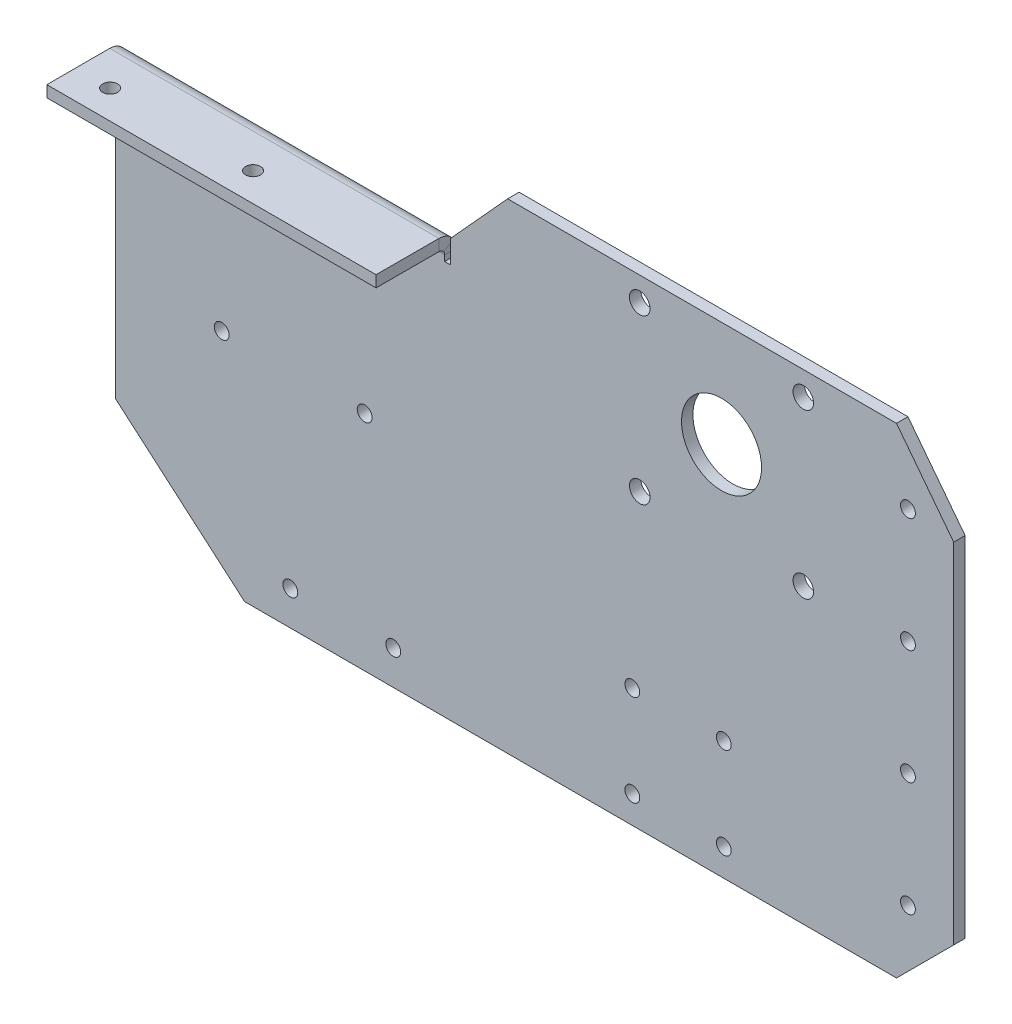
ISO-10303-21;
HEADER;
FILE_DESCRIPTION(('STEP AP214'),'2;1');
FILE_NAME('part.step','',(''),(''),'','','');
FILE_SCHEMA(('AUTOMOTIVE_DESIGN { 1 0 10303 214 1 1 1 1 }'));
ENDSEC;
DATA;
#1=APPLICATION_CONTEXT('core data for automotive mechanical design processes');
#2=APPLICATION_PROTOCOL_DEFINITION('international standard','automotive_design',2000,#1);
#3=PRODUCT_CONTEXT('',#1,'mechanical');
#4=PRODUCT('Part','Part','',(#3));
#5=PRODUCT_RELATED_PRODUCT_CATEGORY('part','',(#4));
#6=PRODUCT_DEFINITION_FORMATION('','',#4);
#7=PRODUCT_DEFINITION_CONTEXT('part definition',#1,'design');
#8=PRODUCT_DEFINITION('design','',#6,#7);
#9=PRODUCT_DEFINITION_SHAPE('','',#8);
#10=(LENGTH_UNIT() NAMED_UNIT(*) SI_UNIT(.MILLI.,.METRE.));
#11=(NAMED_UNIT(*) PLANE_ANGLE_UNIT() SI_UNIT($,.RADIAN.));
#12=(NAMED_UNIT(*) SI_UNIT($,.STERADIAN.) SOLID_ANGLE_UNIT());
#13=UNCERTAINTY_MEASURE_WITH_UNIT(LENGTH_MEASURE(1.E-05),#10,'distance_accuracy_value','');
#14=(GEOMETRIC_REPRESENTATION_CONTEXT(3) GLOBAL_UNCERTAINTY_ASSIGNED_CONTEXT((#13)) GLOBAL_UNIT_ASSIGNED_CONTEXT((#10,
#11,#12)) REPRESENTATION_CONTEXT('',''));
#15=CARTESIAN_POINT('',(0.,0.,0.));
#16=DIRECTION('',(0.,0.,1.));
#17=DIRECTION('',(1.,0.,0.));
#18=AXIS2_PLACEMENT_3D('',#15,#16,#17);
#19=CARTESIAN_POINT('',(97.4349233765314,354.999,44.9999999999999));
#20=DIRECTION('',(0.,1.,0.));
#21=DIRECTION('',(-1.,0.,0.));
#22=AXIS2_PLACEMENT_3D('',#19,#20,#21);
#23=CYLINDRICAL_SURFACE('',#22,6.49999999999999);
#24=CARTESIAN_POINT('',(97.4349233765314,354.999,44.9999999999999));
#25=DIRECTION('',(0.,1.,0.));
#26=DIRECTION('',(-1.,0.,0.));
#27=AXIS2_PLACEMENT_3D('',#24,#25,#26);
#28=CIRCLE('',#27,6.49999999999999);
#29=CARTESIAN_POINT('',(90.9349233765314,354.999,44.9999999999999));
#30=VERTEX_POINT('',#29);
#31=EDGE_CURVE('E207',#30,#30,#28,.T.);
#32=ORIENTED_EDGE('',*,*,#31,.F.);
#33=EDGE_LOOP('',(#32));
#34=FACE_BOUND('',#33,.T.);
#35=CARTESIAN_POINT('',(97.4349233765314,364.999,44.9999999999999));
#36=DIRECTION('',(0.,1.,0.));
#37=DIRECTION('',(-1.,0.,0.));
#38=AXIS2_PLACEMENT_3D('',#35,#36,#37);
#39=CIRCLE('',#38,6.49999999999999);
#40=CARTESIAN_POINT('',(90.9349233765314,364.999,44.9999999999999));
#41=VERTEX_POINT('',#40);
#42=EDGE_CURVE('E442',#41,#41,#39,.T.);
#43=ORIENTED_EDGE('',*,*,#42,.T.);
#44=EDGE_LOOP('',(#43));
#45=FACE_BOUND('',#44,.T.);
#46=ADVANCED_FACE('F30',(#34,#45),#23,.F.);
#47=CARTESIAN_POINT('',(67.1428269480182,364.999,9.99999999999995));
#48=DIRECTION('',(0.,-1.,0.));
#49=DIRECTION('',(0.,0.,-1.));
#50=AXIS2_PLACEMENT_3D('',#47,#48,#49);
#51=PLANE('',#50);
#52=ORIENTED_EDGE('',*,*,#42,.F.);
#53=EDGE_LOOP('',(#52));
#54=FACE_BOUND('',#53,.T.);
#55=CARTESIAN_POINT('',(222.434923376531,364.999,44.9999999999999));
#56=DIRECTION('',(0.,1.,0.));
#57=DIRECTION('',(-1.,0.,0.));
#58=AXIS2_PLACEMENT_3D('',#55,#56,#57);
#59=CIRCLE('',#58,6.50000000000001);
#60=CARTESIAN_POINT('',(215.934923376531,364.999,44.9999999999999));
#61=VERTEX_POINT('',#60);
#62=EDGE_CURVE('E439',#61,#61,#59,.T.);
#63=ORIENTED_EDGE('',*,*,#62,.F.);
#64=EDGE_LOOP('',(#63));
#65=FACE_BOUND('',#64,.T.);
#66=DIRECTION('',(0.000915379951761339,0.,-0.999999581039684));
#67=VECTOR('',#66,1.);
#68=CARTESIAN_POINT('',(354.999,364.999,0.));
#69=LINE('',#68,#67);
#70=CARTESIAN_POINT('',(354.934923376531,364.999,70.));
#71=VERTEX_POINT('',#70);
#72=CARTESIAN_POINT('',(354.985269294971,364.999,15.));
#73=VERTEX_POINT('',#72);
#74=EDGE_CURVE('E48',#71,#73,#69,.T.);
#75=ORIENTED_EDGE('',*,*,#74,.T.);
#76=DIRECTION('',(-1.,0.,0.));
#77=VECTOR('',#76,1.);
#78=CARTESIAN_POINT('',(354.985269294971,364.999,15.0000000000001));
#79=LINE('',#78,#77);
#80=CARTESIAN_POINT('',(67.142826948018,364.999,15.));
#81=VERTEX_POINT('',#80);
#82=EDGE_CURVE('E455',#73,#81,#79,.T.);
#83=ORIENTED_EDGE('',*,*,#82,.T.);
#84=DIRECTION('',(0.,0.,-1.));
#85=VECTOR('',#84,1.);
#86=CARTESIAN_POINT('',(67.1428269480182,364.999,9.99999999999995));
#87=LINE('',#86,#85);
#88=CARTESIAN_POINT('',(67.142826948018,364.999,70.));
#89=VERTEX_POINT('',#88);
#90=EDGE_CURVE('E445',#89,#81,#87,.T.);
#91=ORIENTED_EDGE('',*,*,#90,.F.);
#92=DIRECTION('',(1.,0.,0.));
#93=VECTOR('',#92,1.);
#94=CARTESIAN_POINT('',(354.934923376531,364.999,70.));
#95=LINE('',#94,#93);
#96=EDGE_CURVE('E448',#89,#71,#95,.T.);
#97=ORIENTED_EDGE('',*,*,#96,.T.);
#98=EDGE_LOOP('',(#75,#83,#91,#97));
#99=FACE_BOUND('',#98,.T.);
#100=ADVANCED_FACE('F496',(#54,#65,#99),#51,.F.);
#101=CARTESIAN_POINT('',(222.434923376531,354.999,44.9999999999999));
#102=DIRECTION('',(0.,1.,0.));
#103=DIRECTION('',(-1.,0.,0.));
#104=AXIS2_PLACEMENT_3D('',#101,#102,#103);
#105=CYLINDRICAL_SURFACE('',#104,6.50000000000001);
#106=CARTESIAN_POINT('',(222.434923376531,354.999,44.9999999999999));
#107=DIRECTION('',(0.,1.,0.));
#108=DIRECTION('',(-1.,0.,0.));
#109=AXIS2_PLACEMENT_3D('',#106,#107,#108);
#110=CIRCLE('',#109,6.50000000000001);
#111=CARTESIAN_POINT('',(215.934923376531,354.999,44.9999999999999));
#112=VERTEX_POINT('',#111);
#113=EDGE_CURVE('E203',#112,#112,#110,.T.);
#114=ORIENTED_EDGE('',*,*,#113,.F.);
#115=EDGE_LOOP('',(#114));
#116=FACE_BOUND('',#115,.T.);
#117=ORIENTED_EDGE('',*,*,#62,.T.);
#118=EDGE_LOOP('',(#117));
#119=FACE_BOUND('',#118,.T.);
#120=ADVANCED_FACE('F699',(#116,#119),#105,.F.);
#121=CARTESIAN_POINT('',(354.934923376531,354.999,70.));
#122=DIRECTION('',(0.,-1.,0.));
#123=DIRECTION('',(1.,0.,0.));
#124=AXIS2_PLACEMENT_3D('',#121,#122,#123);
#125=PLANE('',#124);
#126=DIRECTION('',(-1.,0.,0.));
#127=VECTOR('',#126,1.);
#128=CARTESIAN_POINT('',(354.985269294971,354.999,15.0000000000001));
#129=LINE('',#128,#127);
#130=CARTESIAN_POINT('',(354.985269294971,354.999,15.));
#131=VERTEX_POINT('',#130);
#132=CARTESIAN_POINT('',(67.1428269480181,354.999,15.));
#133=VERTEX_POINT('',#132);
#134=EDGE_CURVE('E461',#131,#133,#129,.T.);
#135=ORIENTED_EDGE('',*,*,#134,.F.);
#136=DIRECTION('',(0.000915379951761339,0.,-0.999999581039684));
#137=VECTOR('',#136,1.);
#138=CARTESIAN_POINT('',(354.999,354.999,0.));
#139=LINE('',#138,#137);
#140=CARTESIAN_POINT('',(354.934923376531,354.999,70.));
#141=VERTEX_POINT('',#140);
#142=EDGE_CURVE('E437',#141,#131,#139,.T.);
#143=ORIENTED_EDGE('',*,*,#142,.F.);
#144=DIRECTION('',(1.,0.,0.));
#145=VECTOR('',#144,1.);
#146=CARTESIAN_POINT('',(354.934923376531,354.999,70.));
#147=LINE('',#146,#145);
#148=CARTESIAN_POINT('',(67.142826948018,354.999,70.));
#149=VERTEX_POINT('',#148);
#150=EDGE_CURVE('E56',#149,#141,#147,.T.);
#151=ORIENTED_EDGE('',*,*,#150,.F.);
#152=DIRECTION('',(0.,0.,1.));
#153=VECTOR('',#152,1.);
#154=CARTESIAN_POINT('',(67.142826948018,354.999,0.));
#155=LINE('',#154,#153);
#156=EDGE_CURVE('E11',#133,#149,#155,.T.);
#157=ORIENTED_EDGE('',*,*,#156,.F.);
#158=EDGE_LOOP('',(#135,#143,#151,#157));
#159=FACE_BOUND('',#158,.T.);
#160=ORIENTED_EDGE('',*,*,#113,.T.);
#161=EDGE_LOOP('',(#160));
#162=FACE_BOUND('',#161,.T.);
#163=ORIENTED_EDGE('',*,*,#31,.T.);
#164=EDGE_LOOP('',(#163));
#165=FACE_BOUND('',#164,.T.);
#166=ADVANCED_FACE('F480',(#159,#162,#165),#125,.T.);
#167=CARTESIAN_POINT('',(354.999,-231.100894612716,0.));
#168=DIRECTION('',(0.999999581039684,0.,0.000915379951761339));
#169=DIRECTION('',(-0.000915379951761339,0.,0.999999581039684));
#170=AXIS2_PLACEMENT_3D('',#167,#168,#169);
#171=PLANE('',#170);
#172=ORIENTED_EDGE('',*,*,#74,.F.);
#173=DIRECTION('',(0.,1.,0.));
#174=VECTOR('',#173,1.);
#175=CARTESIAN_POINT('',(354.934923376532,-231.100894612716,70.));
#176=LINE('',#175,#174);
#177=EDGE_CURVE('E457',#141,#71,#176,.T.);
#178=ORIENTED_EDGE('',*,*,#177,.F.);
#179=ORIENTED_EDGE('',*,*,#142,.T.);
#180=CARTESIAN_POINT('',(354.985269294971,364.999,15.));
#181=CARTESIAN_POINT('',(354.985269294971,354.999,15.));
#182=B_SPLINE_CURVE_WITH_KNOTS('',1,(#180,#181),.UNSPECIFIED.,.F.,.F.,(2,2),(0.,1.),.UNSPECIFIED.);
#183=EDGE_CURVE('E40',#131,#73,#182,.F.);
#184=ORIENTED_EDGE('',*,*,#183,.T.);
#185=EDGE_LOOP('',(#172,#178,#179,#184));
#186=FACE_BOUND('',#185,.T.);
#187=ADVANCED_FACE('F32',(#186),#171,.T.);
#188=CARTESIAN_POINT('',(354.934923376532,-231.100894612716,70.));
#189=DIRECTION('',(0.,0.,1.));
#190=DIRECTION('',(-1.,0.,0.));
#191=AXIS2_PLACEMENT_3D('',#188,#189,#190);
#192=PLANE('',#191);
#193=ORIENTED_EDGE('',*,*,#96,.F.);
#194=DIRECTION('',(0.,1.,0.));
#195=VECTOR('',#194,1.);
#196=CARTESIAN_POINT('',(67.1428269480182,-231.100894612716,70.));
#197=LINE('',#196,#195);
#198=EDGE_CURVE('E454',#149,#89,#197,.T.);
#199=ORIENTED_EDGE('',*,*,#198,.F.);
#200=ORIENTED_EDGE('',*,*,#150,.T.);
#201=ORIENTED_EDGE('',*,*,#177,.T.);
#202=EDGE_LOOP('',(#193,#199,#200,#201));
#203=FACE_BOUND('',#202,.T.);
#204=ADVANCED_FACE('F485',(#203),#192,.T.);
#205=CARTESIAN_POINT('',(67.1428269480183,-231.100894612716,0.));
#206=DIRECTION('',(-1.,0.,0.));
#207=DIRECTION('',(0.,0.,-1.));
#208=AXIS2_PLACEMENT_3D('',#205,#206,#207);
#209=PLANE('',#208);
#210=ORIENTED_EDGE('',*,*,#90,.T.);
#211=DIRECTION('',(0.,1.,0.));
#212=VECTOR('',#211,1.);
#213=CARTESIAN_POINT('',(67.1428269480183,-231.100894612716,15.0000000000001));
#214=LINE('',#213,#212);
#215=EDGE_CURVE('E451',#133,#81,#214,.T.);
#216=ORIENTED_EDGE('',*,*,#215,.F.);
#217=ORIENTED_EDGE('',*,*,#156,.T.);
#218=ORIENTED_EDGE('',*,*,#198,.T.);
#219=EDGE_LOOP('',(#210,#216,#217,#218));
#220=FACE_BOUND('',#219,.T.);
#221=ADVANCED_FACE('F488',(#220),#209,.T.);
#222=CARTESIAN_POINT('',(94.8431926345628,344.999000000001,1699.35274040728));
#223=DIRECTION('',(0.,1.,0.));
#224=DIRECTION('',(-1.,0.,0.));
#225=AXIS2_PLACEMENT_3D('',#222,#223,#224);
#226=PLANE('',#225);
#227=DIRECTION('',(0.,0.,-1.));
#228=VECTOR('',#227,1.);
#229=CARTESIAN_POINT('',(359.989846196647,344.999,1699.35274040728));
#230=LINE('',#229,#228);
#231=CARTESIAN_POINT('',(359.989846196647,344.999,10.));
#232=VERTEX_POINT('',#231);
#233=CARTESIAN_POINT('',(359.989846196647,344.999,0.));
#234=VERTEX_POINT('',#233);
#235=EDGE_CURVE('E198',#232,#234,#230,.T.);
#236=ORIENTED_EDGE('',*,*,#235,.T.);
#237=DIRECTION('',(1.,0.,0.));
#238=VECTOR('',#237,1.);
#239=CARTESIAN_POINT('',(94.8431926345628,344.999000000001,0.));
#240=LINE('',#239,#238);
#241=CARTESIAN_POINT('',(354.989846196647,344.999,0.));
#242=VERTEX_POINT('',#241);
#243=EDGE_CURVE('E218',#242,#234,#240,.T.);
#244=ORIENTED_EDGE('',*,*,#243,.F.);
#245=DIRECTION('',(0.,0.,-1.));
#246=VECTOR('',#245,1.);
#247=CARTESIAN_POINT('',(354.989846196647,344.999,1699.35274040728));
#248=LINE('',#247,#246);
#249=CARTESIAN_POINT('',(354.989846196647,344.999,10.));
#250=VERTEX_POINT('',#249);
#251=EDGE_CURVE('E204',#250,#242,#248,.T.);
#252=ORIENTED_EDGE('',*,*,#251,.F.);
#253=DIRECTION('',(1.,0.,0.));
#254=VECTOR('',#253,1.);
#255=CARTESIAN_POINT('',(94.8431926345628,344.999000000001,10.));
#256=LINE('',#255,#254);
#257=EDGE_CURVE('E202',#250,#232,#256,.T.);
#258=ORIENTED_EDGE('',*,*,#257,.T.);
#259=EDGE_LOOP('',(#236,#244,#252,#258));
#260=FACE_BOUND('',#259,.T.);
#261=ADVANCED_FACE('F564',(#260),#226,.T.);
#262=CARTESIAN_POINT('',(359.989846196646,73.3276118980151,1699.35274040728));
#263=DIRECTION('',(-1.,0.,0.));
#264=DIRECTION('',(0.,-1.,0.));
#265=AXIS2_PLACEMENT_3D('',#262,#263,#264);
#266=PLANE('',#265);
#267=DIRECTION('',(0.,0.,-1.));
#268=VECTOR('',#267,1.);
#269=CARTESIAN_POINT('',(359.989846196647,346.999,1699.35274040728));
#270=LINE('',#269,#268);
#271=CARTESIAN_POINT('',(359.989846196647,346.999,10.));
#272=VERTEX_POINT('',#271);
#273=CARTESIAN_POINT('',(359.989846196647,346.999,0.));
#274=VERTEX_POINT('',#273);
#275=EDGE_CURVE('E429',#272,#274,#270,.T.);
#276=ORIENTED_EDGE('',*,*,#275,.T.);
#277=DIRECTION('',(0.,1.,0.));
#278=VECTOR('',#277,1.);
#279=CARTESIAN_POINT('',(359.989846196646,73.3276118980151,0.));
#280=LINE('',#279,#278);
#281=EDGE_CURVE('E209',#234,#274,#280,.T.);
#282=ORIENTED_EDGE('',*,*,#281,.F.);
#283=ORIENTED_EDGE('',*,*,#235,.F.);
#284=DIRECTION('',(0.,1.,0.));
#285=VECTOR('',#284,1.);
#286=CARTESIAN_POINT('',(359.989846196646,73.3276118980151,10.));
#287=LINE('',#286,#285);
#288=EDGE_CURVE('E427',#232,#272,#287,.T.);
#289=ORIENTED_EDGE('',*,*,#288,.T.);
#290=EDGE_LOOP('',(#276,#282,#283,#289));
#291=FACE_BOUND('',#290,.T.);
#292=ADVANCED_FACE('F567',(#291),#266,.T.);
#293=CARTESIAN_POINT('',(354.999,346.999,1699.35274040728));
#294=DIRECTION('',(0.,-1.,0.));
#295=DIRECTION('',(0.,0.,-1.));
#296=AXIS2_PLACEMENT_3D('',#293,#294,#295);
#297=PLANE('',#296);
#298=DIRECTION('',(-1.,0.,0.));
#299=VECTOR('',#298,1.);
#300=CARTESIAN_POINT('',(354.999,346.999,0.));
#301=LINE('',#300,#299);
#302=CARTESIAN_POINT('',(359.999,346.999,0.));
#303=VERTEX_POINT('',#302);
#304=EDGE_CURVE('E424',#303,#274,#301,.T.);
#305=ORIENTED_EDGE('',*,*,#304,.T.);
#306=ORIENTED_EDGE('',*,*,#275,.F.);
#307=DIRECTION('',(-1.,0.,0.));
#308=VECTOR('',#307,1.);
#309=CARTESIAN_POINT('',(354.999,346.999,10.));
#310=LINE('',#309,#308);
#311=CARTESIAN_POINT('',(359.999,346.999,10.));
#312=VERTEX_POINT('',#311);
#313=EDGE_CURVE('E287',#312,#272,#310,.T.);
#314=ORIENTED_EDGE('',*,*,#313,.F.);
#315=DIRECTION('',(0.,0.,-1.));
#316=VECTOR('',#315,1.);
#317=CARTESIAN_POINT('',(359.999,346.999,1699.35274040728));
#318=LINE('',#317,#316);
#319=EDGE_CURVE('E421',#312,#303,#318,.T.);
#320=ORIENTED_EDGE('',*,*,#319,.T.);
#321=EDGE_LOOP('',(#305,#306,#314,#320));
#322=FACE_BOUND('',#321,.T.);
#323=ADVANCED_FACE('F571',(#322),#297,.F.);
#324=CARTESIAN_POINT('',(359.999,346.999,1699.35274040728));
#325=DIRECTION('',(1.,0.,0.));
#326=DIRECTION('',(0.,0.,-1.));
#327=AXIS2_PLACEMENT_3D('',#324,#325,#326);
#328=PLANE('',#327);
#329=DIRECTION('',(0.,-1.,0.));
#330=VECTOR('',#329,1.);
#331=CARTESIAN_POINT('',(359.999,346.999,0.));
#332=LINE('',#331,#330);
#333=CARTESIAN_POINT('',(359.999,364.999,0.));
#334=VERTEX_POINT('',#333);
#335=EDGE_CURVE('E418',#334,#303,#332,.T.);
#336=ORIENTED_EDGE('',*,*,#335,.T.);
#337=ORIENTED_EDGE('',*,*,#319,.F.);
#338=DIRECTION('',(0.,-1.,0.));
#339=VECTOR('',#338,1.);
#340=CARTESIAN_POINT('',(359.999,346.999,10.));
#341=LINE('',#340,#339);
#342=CARTESIAN_POINT('',(359.999,364.999,10.));
#343=VERTEX_POINT('',#342);
#344=EDGE_CURVE('E290',#343,#312,#341,.T.);
#345=ORIENTED_EDGE('',*,*,#344,.F.);
#346=DIRECTION('',(0.,0.,-1.));
#347=VECTOR('',#346,1.);
#348=CARTESIAN_POINT('',(359.999,364.999,1699.35274040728));
#349=LINE('',#348,#347);
#350=EDGE_CURVE('E415',#343,#334,#349,.T.);
#351=ORIENTED_EDGE('',*,*,#350,.T.);
#352=EDGE_LOOP('',(#336,#337,#345,#351));
#353=FACE_BOUND('',#352,.T.);
#354=ADVANCED_FACE('F575',(#353),#328,.F.);
#355=CARTESIAN_POINT('',(359.999,364.999,1699.35274040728));
#356=DIRECTION('',(0.739940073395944,-0.672672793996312,0.));
#357=DIRECTION('',(0.672672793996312,0.739940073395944,0.));
#358=AXIS2_PLACEMENT_3D('',#355,#356,#357);
#359=PLANE('',#358);
#360=DIRECTION('',(-0.672672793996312,-0.739940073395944,0.));
#361=VECTOR('',#360,1.);
#362=CARTESIAN_POINT('',(359.999,364.999,0.));
#363=LINE('',#362,#361);
#364=CARTESIAN_POINT('',(409.999,419.999,0.));
#365=VERTEX_POINT('',#364);
#366=EDGE_CURVE('E412',#365,#334,#363,.T.);
#367=ORIENTED_EDGE('',*,*,#366,.T.);
#368=ORIENTED_EDGE('',*,*,#350,.F.);
#369=DIRECTION('',(-0.672672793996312,-0.739940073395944,0.));
#370=VECTOR('',#369,1.);
#371=CARTESIAN_POINT('',(359.999,364.999,10.));
#372=LINE('',#371,#370);
#373=CARTESIAN_POINT('',(409.999,419.999,10.));
#374=VERTEX_POINT('',#373);
#375=EDGE_CURVE('E293',#374,#343,#372,.T.);
#376=ORIENTED_EDGE('',*,*,#375,.F.);
#377=DIRECTION('',(0.,0.,-1.));
#378=VECTOR('',#377,1.);
#379=CARTESIAN_POINT('',(409.999,419.999,1699.35274040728));
#380=LINE('',#379,#378);
#381=EDGE_CURVE('E409',#374,#365,#380,.T.);
#382=ORIENTED_EDGE('',*,*,#381,.T.);
#383=EDGE_LOOP('',(#367,#368,#376,#382));
#384=FACE_BOUND('',#383,.T.);
#385=ADVANCED_FACE('F579',(#384),#359,.F.);
#386=CARTESIAN_POINT('',(409.999,419.999,1699.35274040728));
#387=DIRECTION('',(0.,-1.,0.));
#388=DIRECTION('',(0.,0.,-1.));
#389=AXIS2_PLACEMENT_3D('',#386,#387,#388);
#390=PLANE('',#389);
#391=DIRECTION('',(-1.,0.,0.));
#392=VECTOR('',#391,1.);
#393=CARTESIAN_POINT('',(409.999,419.999,0.));
#394=LINE('',#393,#392);
#395=CARTESIAN_POINT('',(749.999,419.999,0.));
#396=VERTEX_POINT('',#395);
#397=EDGE_CURVE('E406',#396,#365,#394,.T.);
#398=ORIENTED_EDGE('',*,*,#397,.T.);
#399=ORIENTED_EDGE('',*,*,#381,.F.);
#400=DIRECTION('',(-1.,0.,0.));
#401=VECTOR('',#400,1.);
#402=CARTESIAN_POINT('',(409.999,419.999,10.));
#403=LINE('',#402,#401);
#404=CARTESIAN_POINT('',(749.999,419.999,10.));
#405=VERTEX_POINT('',#404);
#406=EDGE_CURVE('E296',#405,#374,#403,.T.);
#407=ORIENTED_EDGE('',*,*,#406,.F.);
#408=DIRECTION('',(0.,0.,-1.));
#409=VECTOR('',#408,1.);
#410=CARTESIAN_POINT('',(749.999,419.999,1699.35274040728));
#411=LINE('',#410,#409);
#412=EDGE_CURVE('E403',#405,#396,#411,.T.);
#413=ORIENTED_EDGE('',*,*,#412,.T.);
#414=EDGE_LOOP('',(#398,#399,#407,#413));
#415=FACE_BOUND('',#414,.T.);
#416=ADVANCED_FACE('F583',(#415),#390,.F.);
#417=CARTESIAN_POINT('',(749.999,419.999,1699.35274040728));
#418=DIRECTION('',(-0.7926239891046,-0.609710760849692,0.));
#419=DIRECTION('',(0.609710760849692,-0.792623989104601,0.));
#420=AXIS2_PLACEMENT_3D('',#417,#418,#419);
#421=PLANE('',#420);
#422=DIRECTION('',(-0.609710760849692,0.792623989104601,0.));
#423=VECTOR('',#422,1.);
#424=CARTESIAN_POINT('',(749.999,419.999,0.));
#425=LINE('',#424,#423);
#426=CARTESIAN_POINT('',(799.999,354.999,0.));
#427=VERTEX_POINT('',#426);
#428=EDGE_CURVE('E400',#427,#396,#425,.T.);
#429=ORIENTED_EDGE('',*,*,#428,.T.);
#430=ORIENTED_EDGE('',*,*,#412,.F.);
#431=DIRECTION('',(-0.609710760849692,0.792623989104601,0.));
#432=VECTOR('',#431,1.);
#433=CARTESIAN_POINT('',(749.999,419.999,10.));
#434=LINE('',#433,#432);
#435=CARTESIAN_POINT('',(799.999,354.999,10.));
#436=VERTEX_POINT('',#435);
#437=EDGE_CURVE('E299',#436,#405,#434,.T.);
#438=ORIENTED_EDGE('',*,*,#437,.F.);
#439=DIRECTION('',(0.,0.,-1.));
#440=VECTOR('',#439,1.);
#441=CARTESIAN_POINT('',(799.999,354.999,1699.35274040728));
#442=LINE('',#441,#440);
#443=EDGE_CURVE('E397',#436,#427,#442,.T.);
#444=ORIENTED_EDGE('',*,*,#443,.T.);
#445=EDGE_LOOP('',(#429,#430,#438,#444));
#446=FACE_BOUND('',#445,.T.);
#447=ADVANCED_FACE('F587',(#446),#421,.F.);
#448=CARTESIAN_POINT('',(799.999,354.999,1699.35274040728));
#449=DIRECTION('',(-1.,0.,0.));
#450=DIRECTION('',(0.,0.,1.));
#451=AXIS2_PLACEMENT_3D('',#448,#449,#450);
#452=PLANE('',#451);
#453=DIRECTION('',(0.,1.,0.));
#454=VECTOR('',#453,1.);
#455=CARTESIAN_POINT('',(799.999,354.999,0.));
#456=LINE('',#455,#454);
#457=CARTESIAN_POINT('',(799.999,49.999,0.));
#458=VERTEX_POINT('',#457);
#459=EDGE_CURVE('E394',#458,#427,#456,.T.);
#460=ORIENTED_EDGE('',*,*,#459,.T.);
#461=ORIENTED_EDGE('',*,*,#443,.F.);
#462=DIRECTION('',(0.,1.,0.));
#463=VECTOR('',#462,1.);
#464=CARTESIAN_POINT('',(799.999,354.999,10.));
#465=LINE('',#464,#463);
#466=CARTESIAN_POINT('',(799.999,49.999,10.));
#467=VERTEX_POINT('',#466);
#468=EDGE_CURVE('E302',#467,#436,#465,.T.);
#469=ORIENTED_EDGE('',*,*,#468,.F.);
#470=DIRECTION('',(0.,0.,-1.));
#471=VECTOR('',#470,1.);
#472=CARTESIAN_POINT('',(799.999,49.999,1699.35274040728));
#473=LINE('',#472,#471);
#474=EDGE_CURVE('E391',#467,#458,#473,.T.);
#475=ORIENTED_EDGE('',*,*,#474,.T.);
#476=EDGE_LOOP('',(#460,#461,#469,#475));
#477=FACE_BOUND('',#476,.T.);
#478=ADVANCED_FACE('F591',(#477),#452,.F.);
#479=CARTESIAN_POINT('',(799.999,49.999,1699.35274040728));
#480=DIRECTION('',(-0.707106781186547,0.707106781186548,0.));
#481=DIRECTION('',(-0.707106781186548,-0.707106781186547,0.));
#482=AXIS2_PLACEMENT_3D('',#479,#480,#481);
#483=PLANE('',#482);
#484=DIRECTION('',(0.707106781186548,0.707106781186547,0.));
#485=VECTOR('',#484,1.);
#486=CARTESIAN_POINT('',(799.999,49.999,0.));
#487=LINE('',#486,#485);
#488=CARTESIAN_POINT('',(749.999,-0.000999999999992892,0.));
#489=VERTEX_POINT('',#488);
#490=EDGE_CURVE('E388',#489,#458,#487,.T.);
#491=ORIENTED_EDGE('',*,*,#490,.T.);
#492=ORIENTED_EDGE('',*,*,#474,.F.);
#493=DIRECTION('',(0.707106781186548,0.707106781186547,0.));
#494=VECTOR('',#493,1.);
#495=CARTESIAN_POINT('',(799.999,49.999,10.));
#496=LINE('',#495,#494);
#497=CARTESIAN_POINT('',(749.999,-0.000999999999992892,10.));
#498=VERTEX_POINT('',#497);
#499=EDGE_CURVE('E305',#498,#467,#496,.T.);
#500=ORIENTED_EDGE('',*,*,#499,.F.);
#501=DIRECTION('',(0.,0.,-1.));
#502=VECTOR('',#501,1.);
#503=CARTESIAN_POINT('',(749.999,-0.000999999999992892,1699.35274040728));
#504=LINE('',#503,#502);
#505=EDGE_CURVE('E385',#498,#489,#504,.T.);
#506=ORIENTED_EDGE('',*,*,#505,.T.);
#507=EDGE_LOOP('',(#491,#492,#500,#506));
#508=FACE_BOUND('',#507,.T.);
#509=ADVANCED_FACE('F595',(#508),#483,.F.);
#510=CARTESIAN_POINT('',(749.999,-0.000999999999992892,1699.35274040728));
#511=DIRECTION('',(0.,1.,0.));
#512=DIRECTION('',(-1.,0.,0.));
#513=AXIS2_PLACEMENT_3D('',#510,#511,#512);
#514=PLANE('',#513);
#515=DIRECTION('',(1.,0.,0.));
#516=VECTOR('',#515,1.);
#517=CARTESIAN_POINT('',(749.999,-0.000999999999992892,0.));
#518=LINE('',#517,#516);
#519=CARTESIAN_POINT('',(179.999,-0.0010000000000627,0.));
#520=VERTEX_POINT('',#519);
#521=EDGE_CURVE('E382',#520,#489,#518,.T.);
#522=ORIENTED_EDGE('',*,*,#521,.T.);
#523=ORIENTED_EDGE('',*,*,#505,.F.);
#524=DIRECTION('',(1.,0.,0.));
#525=VECTOR('',#524,1.);
#526=CARTESIAN_POINT('',(749.999,-0.000999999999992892,10.));
#527=LINE('',#526,#525);
#528=CARTESIAN_POINT('',(179.999,-0.0010000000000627,10.));
#529=VERTEX_POINT('',#528);
#530=EDGE_CURVE('E308',#529,#498,#527,.T.);
#531=ORIENTED_EDGE('',*,*,#530,.F.);
#532=DIRECTION('',(0.,0.,-1.));
#533=VECTOR('',#532,1.);
#534=CARTESIAN_POINT('',(179.999,-0.0010000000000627,1699.35274040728));
#535=LINE('',#534,#533);
#536=EDGE_CURVE('E379',#529,#520,#535,.T.);
#537=ORIENTED_EDGE('',*,*,#536,.T.);
#538=EDGE_LOOP('',(#522,#523,#531,#537));
#539=FACE_BOUND('',#538,.T.);
#540=ADVANCED_FACE('F599',(#539),#514,.F.);
#541=CARTESIAN_POINT('',(179.999,-0.0010000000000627,1699.35274040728));
#542=DIRECTION('',(0.652523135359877,0.757768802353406,0.));
#543=DIRECTION('',(-0.757768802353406,0.652523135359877,0.));
#544=AXIS2_PLACEMENT_3D('',#541,#542,#543);
#545=PLANE('',#544);
#546=DIRECTION('',(0.757768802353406,-0.652523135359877,0.));
#547=VECTOR('',#546,1.);
#548=CARTESIAN_POINT('',(179.999,-0.0010000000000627,0.));
#549=LINE('',#548,#547);
#550=CARTESIAN_POINT('',(67.1428269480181,97.1807045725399,0.));
#551=VERTEX_POINT('',#550);
#552=EDGE_CURVE('E376',#551,#520,#549,.T.);
#553=ORIENTED_EDGE('',*,*,#552,.T.);
#554=ORIENTED_EDGE('',*,*,#536,.F.);
#555=DIRECTION('',(0.757768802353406,-0.652523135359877,0.));
#556=VECTOR('',#555,1.);
#557=CARTESIAN_POINT('',(179.999,-0.0010000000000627,10.));
#558=LINE('',#557,#556);
#559=CARTESIAN_POINT('',(67.1428269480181,97.1807045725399,10.));
#560=VERTEX_POINT('',#559);
#561=EDGE_CURVE('E311',#560,#529,#558,.T.);
#562=ORIENTED_EDGE('',*,*,#561,.F.);
#563=DIRECTION('',(0.,0.,-1.));
#564=VECTOR('',#563,1.);
#565=CARTESIAN_POINT('',(67.1428269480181,97.1807045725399,1699.35274040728));
#566=LINE('',#565,#564);
#567=EDGE_CURVE('E373',#560,#551,#566,.T.);
#568=ORIENTED_EDGE('',*,*,#567,.T.);
#569=EDGE_LOOP('',(#553,#554,#562,#568));
#570=FACE_BOUND('',#569,.T.);
#571=ADVANCED_FACE('F603',(#570),#545,.F.);
#572=CARTESIAN_POINT('',(759.999,59.999,10.));
#573=DIRECTION('',(0.,0.,-1.));
#574=DIRECTION('',(-1.,0.,0.));
#575=AXIS2_PLACEMENT_3D('',#572,#573,#574);
#576=CYLINDRICAL_SURFACE('',#575,6.4999999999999);
#577=CARTESIAN_POINT('',(759.999,59.999,10.));
#578=DIRECTION('',(0.,0.,1.));
#579=DIRECTION('',(1.,0.,0.));
#580=AXIS2_PLACEMENT_3D('',#577,#578,#579);
#581=CIRCLE('',#580,6.4999999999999);
#582=CARTESIAN_POINT('',(766.499,59.999,10.));
#583=VERTEX_POINT('',#582);
#584=EDGE_CURVE('E370',#583,#583,#581,.T.);
#585=ORIENTED_EDGE('',*,*,#584,.T.);
#586=EDGE_LOOP('',(#585));
#587=FACE_BOUND('',#586,.T.);
#588=CARTESIAN_POINT('',(759.999,59.999,0.));
#589=DIRECTION('',(0.,0.,1.));
#590=DIRECTION('',(1.,0.,0.));
#591=AXIS2_PLACEMENT_3D('',#588,#589,#590);
#592=CIRCLE('',#591,6.4999999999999);
#593=CARTESIAN_POINT('',(766.499,59.999,0.));
#594=VERTEX_POINT('',#593);
#595=EDGE_CURVE('E224',#594,#594,#592,.T.);
#596=ORIENTED_EDGE('',*,*,#595,.F.);
#597=EDGE_LOOP('',(#596));
#598=FACE_BOUND('',#597,.T.);
#599=ADVANCED_FACE('F607',(#587,#598),#576,.F.);
#600=CARTESIAN_POINT('',(284.999,314.999,10.));
#601=DIRECTION('',(0.,0.,-1.));
#602=DIRECTION('',(-1.,0.,0.));
#603=AXIS2_PLACEMENT_3D('',#600,#601,#602);
#604=CYLINDRICAL_SURFACE('',#603,6.50000000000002);
#605=CARTESIAN_POINT('',(284.999,314.999,10.));
#606=DIRECTION('',(0.,0.,1.));
#607=DIRECTION('',(1.,0.,0.));
#608=AXIS2_PLACEMENT_3D('',#605,#606,#607);
#609=CIRCLE('',#608,6.50000000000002);
#610=CARTESIAN_POINT('',(291.499,314.999,10.));
#611=VERTEX_POINT('',#610);
#612=EDGE_CURVE('E367',#611,#611,#609,.T.);
#613=ORIENTED_EDGE('',*,*,#612,.T.);
#614=EDGE_LOOP('',(#613));
#615=FACE_BOUND('',#614,.T.);
#616=CARTESIAN_POINT('',(284.999,314.999,0.));
#617=DIRECTION('',(0.,0.,1.));
#618=DIRECTION('',(1.,0.,0.));
#619=AXIS2_PLACEMENT_3D('',#616,#617,#618);
#620=CIRCLE('',#619,6.50000000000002);
#621=CARTESIAN_POINT('',(291.499,314.999,0.));
#622=VERTEX_POINT('',#621);
#623=EDGE_CURVE('E227',#622,#622,#620,.T.);
#624=ORIENTED_EDGE('',*,*,#623,.F.);
#625=EDGE_LOOP('',(#624));
#626=FACE_BOUND('',#625,.T.);
#627=ADVANCED_FACE('F611',(#615,#626),#604,.F.);
#628=CARTESIAN_POINT('',(284.999,194.999,10.));
#629=DIRECTION('',(0.,0.,-1.));
#630=DIRECTION('',(-1.,0.,0.));
#631=AXIS2_PLACEMENT_3D('',#628,#629,#630);
#632=CYLINDRICAL_SURFACE('',#631,6.50000000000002);
#633=CARTESIAN_POINT('',(284.999,194.999,10.));
#634=DIRECTION('',(0.,0.,1.));
#635=DIRECTION('',(1.,0.,0.));
#636=AXIS2_PLACEMENT_3D('',#633,#634,#635);
#637=CIRCLE('',#636,6.50000000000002);
#638=CARTESIAN_POINT('',(291.499,194.999,10.));
#639=VERTEX_POINT('',#638);
#640=EDGE_CURVE('E364',#639,#639,#637,.T.);
#641=ORIENTED_EDGE('',*,*,#640,.T.);
#642=EDGE_LOOP('',(#641));
#643=FACE_BOUND('',#642,.T.);
#644=CARTESIAN_POINT('',(284.999,194.999,0.));
#645=DIRECTION('',(0.,0.,1.));
#646=DIRECTION('',(1.,0.,0.));
#647=AXIS2_PLACEMENT_3D('',#644,#645,#646);
#648=CIRCLE('',#647,6.50000000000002);
#649=CARTESIAN_POINT('',(291.499,194.999,0.));
#650=VERTEX_POINT('',#649);
#651=EDGE_CURVE('E230',#650,#650,#648,.T.);
#652=ORIENTED_EDGE('',*,*,#651,.F.);
#653=EDGE_LOOP('',(#652));
#654=FACE_BOUND('',#653,.T.);
#655=ADVANCED_FACE('F615',(#643,#654),#632,.F.);
#656=CARTESIAN_POINT('',(219.999,29.9989999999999,10.));
#657=DIRECTION('',(0.,0.,-1.));
#658=DIRECTION('',(-1.,0.,0.));
#659=AXIS2_PLACEMENT_3D('',#656,#657,#658);
#660=CYLINDRICAL_SURFACE('',#659,6.50000000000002);
#661=CARTESIAN_POINT('',(219.999,29.9989999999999,10.));
#662=DIRECTION('',(0.,0.,1.));
#663=DIRECTION('',(1.,0.,0.));
#664=AXIS2_PLACEMENT_3D('',#661,#662,#663);
#665=CIRCLE('',#664,6.50000000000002);
#666=CARTESIAN_POINT('',(226.499,29.9989999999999,10.));
#667=VERTEX_POINT('',#666);
#668=EDGE_CURVE('E361',#667,#667,#665,.T.);
#669=ORIENTED_EDGE('',*,*,#668,.T.);
#670=EDGE_LOOP('',(#669));
#671=FACE_BOUND('',#670,.T.);
#672=CARTESIAN_POINT('',(219.999,29.9989999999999,0.));
#673=DIRECTION('',(0.,0.,1.));
#674=DIRECTION('',(1.,0.,0.));
#675=AXIS2_PLACEMENT_3D('',#672,#673,#674);
#676=CIRCLE('',#675,6.50000000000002);
#677=CARTESIAN_POINT('',(226.499,29.9989999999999,0.));
#678=VERTEX_POINT('',#677);
#679=EDGE_CURVE('E233',#678,#678,#676,.T.);
#680=ORIENTED_EDGE('',*,*,#679,.F.);
#681=EDGE_LOOP('',(#680));
#682=FACE_BOUND('',#681,.T.);
#683=ADVANCED_FACE('F619',(#671,#682),#660,.F.);
#684=CARTESIAN_POINT('',(518.999,23.999,10.));
#685=DIRECTION('',(0.,0.,-1.));
#686=DIRECTION('',(-1.,0.,0.));
#687=AXIS2_PLACEMENT_3D('',#684,#685,#686);
#688=CYLINDRICAL_SURFACE('',#687,6.50000000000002);
#689=CARTESIAN_POINT('',(518.999,23.999,10.));
#690=DIRECTION('',(0.,0.,1.));
#691=DIRECTION('',(1.,0.,0.));
#692=AXIS2_PLACEMENT_3D('',#689,#690,#691);
#693=CIRCLE('',#692,6.50000000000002);
#694=CARTESIAN_POINT('',(525.499,23.999,10.));
#695=VERTEX_POINT('',#694);
#696=EDGE_CURVE('E358',#695,#695,#693,.T.);
#697=ORIENTED_EDGE('',*,*,#696,.T.);
#698=EDGE_LOOP('',(#697));
#699=FACE_BOUND('',#698,.T.);
#700=CARTESIAN_POINT('',(518.999,23.999,0.));
#701=DIRECTION('',(0.,0.,1.));
#702=DIRECTION('',(1.,0.,0.));
#703=AXIS2_PLACEMENT_3D('',#700,#701,#702);
#704=CIRCLE('',#703,6.50000000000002);
#705=CARTESIAN_POINT('',(525.499,23.999,0.));
#706=VERTEX_POINT('',#705);
#707=EDGE_CURVE('E236',#706,#706,#704,.T.);
#708=ORIENTED_EDGE('',*,*,#707,.F.);
#709=EDGE_LOOP('',(#708));
#710=FACE_BOUND('',#709,.T.);
#711=ADVANCED_FACE('F623',(#699,#710),#688,.F.);
#712=CARTESIAN_POINT('',(598.999,23.999,10.));
#713=DIRECTION('',(0.,0.,-1.));
#714=DIRECTION('',(-1.,0.,0.));
#715=AXIS2_PLACEMENT_3D('',#712,#713,#714);
#716=CYLINDRICAL_SURFACE('',#715,6.4999999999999);
#717=CARTESIAN_POINT('',(598.999,23.999,10.));
#718=DIRECTION('',(0.,0.,1.));
#719=DIRECTION('',(1.,0.,0.));
#720=AXIS2_PLACEMENT_3D('',#717,#718,#719);
#721=CIRCLE('',#720,6.4999999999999);
#722=CARTESIAN_POINT('',(605.499,23.999,10.));
#723=VERTEX_POINT('',#722);
#724=EDGE_CURVE('E355',#723,#723,#721,.T.);
#725=ORIENTED_EDGE('',*,*,#724,.T.);
#726=EDGE_LOOP('',(#725));
#727=FACE_BOUND('',#726,.T.);
#728=CARTESIAN_POINT('',(598.999,23.999,0.));
#729=DIRECTION('',(0.,0.,1.));
#730=DIRECTION('',(1.,0.,0.));
#731=AXIS2_PLACEMENT_3D('',#728,#729,#730);
#732=CIRCLE('',#731,6.4999999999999);
#733=CARTESIAN_POINT('',(605.499,23.999,0.));
#734=VERTEX_POINT('',#733);
#735=EDGE_CURVE('E239',#734,#734,#732,.T.);
#736=ORIENTED_EDGE('',*,*,#735,.F.);
#737=EDGE_LOOP('',(#736));
#738=FACE_BOUND('',#737,.T.);
#739=ADVANCED_FACE('F627',(#727,#738),#716,.F.);
#740=CARTESIAN_POINT('',(596.999,327.499,10.));
#741=DIRECTION('',(0.,0.,-1.));
#742=DIRECTION('',(-1.,0.,0.));
#743=AXIS2_PLACEMENT_3D('',#740,#741,#742);
#744=CYLINDRICAL_SURFACE('',#743,35.);
#745=CARTESIAN_POINT('',(596.999,327.499,10.));
#746=DIRECTION('',(0.,0.,1.));
#747=DIRECTION('',(1.,0.,0.));
#748=AXIS2_PLACEMENT_3D('',#745,#746,#747);
#749=CIRCLE('',#748,35.);
#750=CARTESIAN_POINT('',(631.999,327.499,10.));
#751=VERTEX_POINT('',#750);
#752=EDGE_CURVE('E352',#751,#751,#749,.T.);
#753=ORIENTED_EDGE('',*,*,#752,.T.);
#754=EDGE_LOOP('',(#753));
#755=FACE_BOUND('',#754,.T.);
#756=CARTESIAN_POINT('',(596.999,327.499,0.));
#757=DIRECTION('',(0.,0.,1.));
#758=DIRECTION('',(1.,0.,0.));
#759=AXIS2_PLACEMENT_3D('',#756,#757,#758);
#760=CIRCLE('',#759,35.);
#761=CARTESIAN_POINT('',(631.999,327.499,0.));
#762=VERTEX_POINT('',#761);
#763=EDGE_CURVE('E242',#762,#762,#760,.T.);
#764=ORIENTED_EDGE('',*,*,#763,.F.);
#765=EDGE_LOOP('',(#764));
#766=FACE_BOUND('',#765,.T.);
#767=ADVANCED_FACE('F631',(#755,#766),#744,.F.);
#768=CARTESIAN_POINT('',(525.499,255.999,10.));
#769=DIRECTION('',(0.,0.,-1.));
#770=DIRECTION('',(-1.,0.,0.));
#771=AXIS2_PLACEMENT_3D('',#768,#769,#770);
#772=CYLINDRICAL_SURFACE('',#771,9.00000000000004);
#773=CARTESIAN_POINT('',(525.499,255.999,10.));
#774=DIRECTION('',(0.,0.,1.));
#775=DIRECTION('',(1.,0.,0.));
#776=AXIS2_PLACEMENT_3D('',#773,#774,#775);
#777=CIRCLE('',#776,9.00000000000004);
#778=CARTESIAN_POINT('',(534.499,255.999,10.));
#779=VERTEX_POINT('',#778);
#780=EDGE_CURVE('E349',#779,#779,#777,.T.);
#781=ORIENTED_EDGE('',*,*,#780,.T.);
#782=EDGE_LOOP('',(#781));
#783=FACE_BOUND('',#782,.T.);
#784=CARTESIAN_POINT('',(525.499,255.999,0.));
#785=DIRECTION('',(0.,0.,1.));
#786=DIRECTION('',(1.,0.,0.));
#787=AXIS2_PLACEMENT_3D('',#784,#785,#786);
#788=CIRCLE('',#787,9.00000000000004);
#789=CARTESIAN_POINT('',(534.499,255.999,0.));
#790=VERTEX_POINT('',#789);
#791=EDGE_CURVE('E245',#790,#790,#788,.T.);
#792=ORIENTED_EDGE('',*,*,#791,.F.);
#793=EDGE_LOOP('',(#792));
#794=FACE_BOUND('',#793,.T.);
#795=ADVANCED_FACE('F635',(#783,#794),#772,.F.);
#796=CARTESIAN_POINT('',(668.499,255.999,10.));
#797=DIRECTION('',(0.,0.,-1.));
#798=DIRECTION('',(-1.,0.,0.));
#799=AXIS2_PLACEMENT_3D('',#796,#797,#798);
#800=CYLINDRICAL_SURFACE('',#799,9.00000000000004);
#801=CARTESIAN_POINT('',(668.499,255.999,10.));
#802=DIRECTION('',(0.,0.,1.));
#803=DIRECTION('',(1.,0.,0.));
#804=AXIS2_PLACEMENT_3D('',#801,#802,#803);
#805=CIRCLE('',#804,9.00000000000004);
#806=CARTESIAN_POINT('',(677.499,255.999,10.));
#807=VERTEX_POINT('',#806);
#808=EDGE_CURVE('E346',#807,#807,#805,.T.);
#809=ORIENTED_EDGE('',*,*,#808,.T.);
#810=EDGE_LOOP('',(#809));
#811=FACE_BOUND('',#810,.T.);
#812=CARTESIAN_POINT('',(668.499,255.999,0.));
#813=DIRECTION('',(0.,0.,1.));
#814=DIRECTION('',(1.,0.,0.));
#815=AXIS2_PLACEMENT_3D('',#812,#813,#814);
#816=CIRCLE('',#815,9.00000000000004);
#817=CARTESIAN_POINT('',(677.499,255.999,0.));
#818=VERTEX_POINT('',#817);
#819=EDGE_CURVE('E248',#818,#818,#816,.T.);
#820=ORIENTED_EDGE('',*,*,#819,.F.);
#821=EDGE_LOOP('',(#820));
#822=FACE_BOUND('',#821,.T.);
#823=ADVANCED_FACE('F639',(#811,#822),#800,.F.);
#824=CARTESIAN_POINT('',(759.999,359.999,10.));
#825=DIRECTION('',(0.,0.,-1.));
#826=DIRECTION('',(-1.,0.,0.));
#827=AXIS2_PLACEMENT_3D('',#824,#825,#826);
#828=CYLINDRICAL_SURFACE('',#827,6.49999999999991);
#829=CARTESIAN_POINT('',(759.999,359.999,10.));
#830=DIRECTION('',(0.,0.,1.));
#831=DIRECTION('',(1.,0.,0.));
#832=AXIS2_PLACEMENT_3D('',#829,#830,#831);
#833=CIRCLE('',#832,6.49999999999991);
#834=CARTESIAN_POINT('',(766.499,359.999,10.));
#835=VERTEX_POINT('',#834);
#836=EDGE_CURVE('E343',#835,#835,#833,.T.);
#837=ORIENTED_EDGE('',*,*,#836,.T.);
#838=EDGE_LOOP('',(#837));
#839=FACE_BOUND('',#838,.T.);
#840=CARTESIAN_POINT('',(759.999,359.999,0.));
#841=DIRECTION('',(0.,0.,1.));
#842=DIRECTION('',(1.,0.,0.));
#843=AXIS2_PLACEMENT_3D('',#840,#841,#842);
#844=CIRCLE('',#843,6.49999999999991);
#845=CARTESIAN_POINT('',(766.499,359.999,0.));
#846=VERTEX_POINT('',#845);
#847=EDGE_CURVE('E251',#846,#846,#844,.T.);
#848=ORIENTED_EDGE('',*,*,#847,.F.);
#849=EDGE_LOOP('',(#848));
#850=FACE_BOUND('',#849,.T.);
#851=ADVANCED_FACE('F643',(#839,#850),#828,.F.);
#852=CARTESIAN_POINT('',(668.499,398.999,10.));
#853=DIRECTION('',(0.,0.,-1.));
#854=DIRECTION('',(-1.,0.,0.));
#855=AXIS2_PLACEMENT_3D('',#852,#853,#854);
#856=CYLINDRICAL_SURFACE('',#855,9.00000000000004);
#857=CARTESIAN_POINT('',(668.499,398.999,10.));
#858=DIRECTION('',(0.,0.,1.));
#859=DIRECTION('',(1.,0.,0.));
#860=AXIS2_PLACEMENT_3D('',#857,#858,#859);
#861=CIRCLE('',#860,9.00000000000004);
#862=CARTESIAN_POINT('',(677.499,398.999,10.));
#863=VERTEX_POINT('',#862);
#864=EDGE_CURVE('E340',#863,#863,#861,.T.);
#865=ORIENTED_EDGE('',*,*,#864,.T.);
#866=EDGE_LOOP('',(#865));
#867=FACE_BOUND('',#866,.T.);
#868=CARTESIAN_POINT('',(668.499,398.999,0.));
#869=DIRECTION('',(0.,0.,1.));
#870=DIRECTION('',(1.,0.,0.));
#871=AXIS2_PLACEMENT_3D('',#868,#869,#870);
#872=CIRCLE('',#871,9.00000000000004);
#873=CARTESIAN_POINT('',(677.499,398.999,0.));
#874=VERTEX_POINT('',#873);
#875=EDGE_CURVE('E254',#874,#874,#872,.T.);
#876=ORIENTED_EDGE('',*,*,#875,.F.);
#877=EDGE_LOOP('',(#876));
#878=FACE_BOUND('',#877,.T.);
#879=ADVANCED_FACE('F647',(#867,#878),#856,.F.);
#880=CARTESIAN_POINT('',(525.499,398.999,10.));
#881=DIRECTION('',(0.,0.,-1.));
#882=DIRECTION('',(-1.,0.,0.));
#883=AXIS2_PLACEMENT_3D('',#880,#881,#882);
#884=CYLINDRICAL_SURFACE('',#883,9.00000000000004);
#885=CARTESIAN_POINT('',(525.499,398.999,10.));
#886=DIRECTION('',(0.,0.,1.));
#887=DIRECTION('',(1.,0.,0.));
#888=AXIS2_PLACEMENT_3D('',#885,#886,#887);
#889=CIRCLE('',#888,9.00000000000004);
#890=CARTESIAN_POINT('',(534.499,398.999,10.));
#891=VERTEX_POINT('',#890);
#892=EDGE_CURVE('E337',#891,#891,#889,.T.);
#893=ORIENTED_EDGE('',*,*,#892,.T.);
#894=EDGE_LOOP('',(#893));
#895=FACE_BOUND('',#894,.T.);
#896=CARTESIAN_POINT('',(525.499,398.999,0.));
#897=DIRECTION('',(0.,0.,1.));
#898=DIRECTION('',(1.,0.,0.));
#899=AXIS2_PLACEMENT_3D('',#896,#897,#898);
#900=CIRCLE('',#899,9.00000000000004);
#901=CARTESIAN_POINT('',(534.499,398.999,0.));
#902=VERTEX_POINT('',#901);
#903=EDGE_CURVE('E257',#902,#902,#900,.T.);
#904=ORIENTED_EDGE('',*,*,#903,.F.);
#905=EDGE_LOOP('',(#904));
#906=FACE_BOUND('',#905,.T.);
#907=ADVANCED_FACE('F651',(#895,#906),#884,.F.);
#908=CARTESIAN_POINT('',(759.999,259.999,10.));
#909=DIRECTION('',(0.,0.,-1.));
#910=DIRECTION('',(-1.,0.,0.));
#911=AXIS2_PLACEMENT_3D('',#908,#909,#910);
#912=CYLINDRICAL_SURFACE('',#911,6.49999999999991);
#913=CARTESIAN_POINT('',(759.999,259.999,10.));
#914=DIRECTION('',(0.,0.,1.));
#915=DIRECTION('',(1.,0.,0.));
#916=AXIS2_PLACEMENT_3D('',#913,#914,#915);
#917=CIRCLE('',#916,6.49999999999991);
#918=CARTESIAN_POINT('',(766.499,259.999,10.));
#919=VERTEX_POINT('',#918);
#920=EDGE_CURVE('E334',#919,#919,#917,.T.);
#921=ORIENTED_EDGE('',*,*,#920,.T.);
#922=EDGE_LOOP('',(#921));
#923=FACE_BOUND('',#922,.T.);
#924=CARTESIAN_POINT('',(759.999,259.999,0.));
#925=DIRECTION('',(0.,0.,1.));
#926=DIRECTION('',(1.,0.,0.));
#927=AXIS2_PLACEMENT_3D('',#924,#925,#926);
#928=CIRCLE('',#927,6.49999999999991);
#929=CARTESIAN_POINT('',(766.499,259.999,0.));
#930=VERTEX_POINT('',#929);
#931=EDGE_CURVE('E260',#930,#930,#928,.T.);
#932=ORIENTED_EDGE('',*,*,#931,.F.);
#933=EDGE_LOOP('',(#932));
#934=FACE_BOUND('',#933,.T.);
#935=ADVANCED_FACE('F655',(#923,#934),#912,.F.);
#936=CARTESIAN_POINT('',(598.999,103.999,10.));
#937=DIRECTION('',(0.,0.,-1.));
#938=DIRECTION('',(-1.,0.,0.));
#939=AXIS2_PLACEMENT_3D('',#936,#937,#938);
#940=CYLINDRICAL_SURFACE('',#939,6.4999999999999);
#941=CARTESIAN_POINT('',(598.999,103.999,10.));
#942=DIRECTION('',(0.,0.,1.));
#943=DIRECTION('',(1.,0.,0.));
#944=AXIS2_PLACEMENT_3D('',#941,#942,#943);
#945=CIRCLE('',#944,6.4999999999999);
#946=CARTESIAN_POINT('',(605.499,103.999,10.));
#947=VERTEX_POINT('',#946);
#948=EDGE_CURVE('E331',#947,#947,#945,.T.);
#949=ORIENTED_EDGE('',*,*,#948,.T.);
#950=EDGE_LOOP('',(#949));
#951=FACE_BOUND('',#950,.T.);
#952=CARTESIAN_POINT('',(598.999,103.999,0.));
#953=DIRECTION('',(0.,0.,1.));
#954=DIRECTION('',(1.,0.,0.));
#955=AXIS2_PLACEMENT_3D('',#952,#953,#954);
#956=CIRCLE('',#955,6.4999999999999);
#957=CARTESIAN_POINT('',(605.499,103.999,0.));
#958=VERTEX_POINT('',#957);
#959=EDGE_CURVE('E263',#958,#958,#956,.T.);
#960=ORIENTED_EDGE('',*,*,#959,.F.);
#961=EDGE_LOOP('',(#960));
#962=FACE_BOUND('',#961,.T.);
#963=ADVANCED_FACE('F659',(#951,#962),#940,.F.);
#964=CARTESIAN_POINT('',(518.999,103.999,10.));
#965=DIRECTION('',(0.,0.,-1.));
#966=DIRECTION('',(-1.,0.,0.));
#967=AXIS2_PLACEMENT_3D('',#964,#965,#966);
#968=CYLINDRICAL_SURFACE('',#967,6.50000000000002);
#969=CARTESIAN_POINT('',(518.999,103.999,10.));
#970=DIRECTION('',(0.,0.,1.));
#971=DIRECTION('',(1.,0.,0.));
#972=AXIS2_PLACEMENT_3D('',#969,#970,#971);
#973=CIRCLE('',#972,6.50000000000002);
#974=CARTESIAN_POINT('',(525.499,103.999,10.));
#975=VERTEX_POINT('',#974);
#976=EDGE_CURVE('E328',#975,#975,#973,.T.);
#977=ORIENTED_EDGE('',*,*,#976,.T.);
#978=EDGE_LOOP('',(#977));
#979=FACE_BOUND('',#978,.T.);
#980=CARTESIAN_POINT('',(518.999,103.999,0.));
#981=DIRECTION('',(0.,0.,1.));
#982=DIRECTION('',(1.,0.,0.));
#983=AXIS2_PLACEMENT_3D('',#980,#981,#982);
#984=CIRCLE('',#983,6.50000000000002);
#985=CARTESIAN_POINT('',(525.499,103.999,0.));
#986=VERTEX_POINT('',#985);
#987=EDGE_CURVE('E266',#986,#986,#984,.T.);
#988=ORIENTED_EDGE('',*,*,#987,.F.);
#989=EDGE_LOOP('',(#988));
#990=FACE_BOUND('',#989,.T.);
#991=ADVANCED_FACE('F663',(#979,#990),#968,.F.);
#992=CARTESIAN_POINT('',(309.999,29.9989999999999,10.));
#993=DIRECTION('',(0.,0.,-1.));
#994=DIRECTION('',(-1.,0.,0.));
#995=AXIS2_PLACEMENT_3D('',#992,#993,#994);
#996=CYLINDRICAL_SURFACE('',#995,6.50000000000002);
#997=CARTESIAN_POINT('',(309.999,29.9989999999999,10.));
#998=DIRECTION('',(0.,0.,1.));
#999=DIRECTION('',(1.,0.,0.));
#1000=AXIS2_PLACEMENT_3D('',#997,#998,#999);
#1001=CIRCLE('',#1000,6.50000000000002);
#1002=CARTESIAN_POINT('',(316.499,29.9989999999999,10.));
#1003=VERTEX_POINT('',#1002);
#1004=EDGE_CURVE('E325',#1003,#1003,#1001,.T.);
#1005=ORIENTED_EDGE('',*,*,#1004,.T.);
#1006=EDGE_LOOP('',(#1005));
#1007=FACE_BOUND('',#1006,.T.);
#1008=CARTESIAN_POINT('',(309.999,29.9989999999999,0.));
#1009=DIRECTION('',(0.,0.,1.));
#1010=DIRECTION('',(1.,0.,0.));
#1011=AXIS2_PLACEMENT_3D('',#1008,#1009,#1010);
#1012=CIRCLE('',#1011,6.50000000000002);
#1013=CARTESIAN_POINT('',(316.499,29.9989999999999,0.));
#1014=VERTEX_POINT('',#1013);
#1015=EDGE_CURVE('E269',#1014,#1014,#1012,.T.);
#1016=ORIENTED_EDGE('',*,*,#1015,.F.);
#1017=EDGE_LOOP('',(#1016));
#1018=FACE_BOUND('',#1017,.T.);
#1019=ADVANCED_FACE('F667',(#1007,#1018),#996,.F.);
#1020=CARTESIAN_POINT('',(159.999,194.999,10.));
#1021=DIRECTION('',(0.,0.,-1.));
#1022=DIRECTION('',(-1.,0.,0.));
#1023=AXIS2_PLACEMENT_3D('',#1020,#1021,#1022);
#1024=CYLINDRICAL_SURFACE('',#1023,6.50000000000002);
#1025=CARTESIAN_POINT('',(159.999,194.999,10.));
#1026=DIRECTION('',(0.,0.,1.));
#1027=DIRECTION('',(1.,0.,0.));
#1028=AXIS2_PLACEMENT_3D('',#1025,#1026,#1027);
#1029=CIRCLE('',#1028,6.50000000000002);
#1030=CARTESIAN_POINT('',(166.499,194.999,10.));
#1031=VERTEX_POINT('',#1030);
#1032=EDGE_CURVE('E322',#1031,#1031,#1029,.T.);
#1033=ORIENTED_EDGE('',*,*,#1032,.T.);
#1034=EDGE_LOOP('',(#1033));
#1035=FACE_BOUND('',#1034,.T.);
#1036=CARTESIAN_POINT('',(159.999,194.999,0.));
#1037=DIRECTION('',(0.,0.,1.));
#1038=DIRECTION('',(1.,0.,0.));
#1039=AXIS2_PLACEMENT_3D('',#1036,#1037,#1038);
#1040=CIRCLE('',#1039,6.50000000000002);
#1041=CARTESIAN_POINT('',(166.499,194.999,0.));
#1042=VERTEX_POINT('',#1041);
#1043=EDGE_CURVE('E272',#1042,#1042,#1040,.T.);
#1044=ORIENTED_EDGE('',*,*,#1043,.F.);
#1045=EDGE_LOOP('',(#1044));
#1046=FACE_BOUND('',#1045,.T.);
#1047=ADVANCED_FACE('F671',(#1035,#1046),#1024,.F.);
#1048=CARTESIAN_POINT('',(159.999,314.999,10.));
#1049=DIRECTION('',(0.,0.,-1.));
#1050=DIRECTION('',(-1.,0.,0.));
#1051=AXIS2_PLACEMENT_3D('',#1048,#1049,#1050);
#1052=CYLINDRICAL_SURFACE('',#1051,6.50000000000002);
#1053=CARTESIAN_POINT('',(159.999,314.999,10.));
#1054=DIRECTION('',(0.,0.,1.));
#1055=DIRECTION('',(1.,0.,0.));
#1056=AXIS2_PLACEMENT_3D('',#1053,#1054,#1055);
#1057=CIRCLE('',#1056,6.50000000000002);
#1058=CARTESIAN_POINT('',(166.499,314.999,10.));
#1059=VERTEX_POINT('',#1058);
#1060=EDGE_CURVE('E319',#1059,#1059,#1057,.T.);
#1061=ORIENTED_EDGE('',*,*,#1060,.T.);
#1062=EDGE_LOOP('',(#1061));
#1063=FACE_BOUND('',#1062,.T.);
#1064=CARTESIAN_POINT('',(159.999,314.999,0.));
#1065=DIRECTION('',(0.,0.,1.));
#1066=DIRECTION('',(1.,0.,0.));
#1067=AXIS2_PLACEMENT_3D('',#1064,#1065,#1066);
#1068=CIRCLE('',#1067,6.50000000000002);
#1069=CARTESIAN_POINT('',(166.499,314.999,0.));
#1070=VERTEX_POINT('',#1069);
#1071=EDGE_CURVE('E275',#1070,#1070,#1068,.T.);
#1072=ORIENTED_EDGE('',*,*,#1071,.F.);
#1073=EDGE_LOOP('',(#1072));
#1074=FACE_BOUND('',#1073,.T.);
#1075=ADVANCED_FACE('F675',(#1063,#1074),#1052,.F.);
#1076=CARTESIAN_POINT('',(759.999,159.999,10.));
#1077=DIRECTION('',(0.,0.,-1.));
#1078=DIRECTION('',(-1.,0.,0.));
#1079=AXIS2_PLACEMENT_3D('',#1076,#1077,#1078);
#1080=CYLINDRICAL_SURFACE('',#1079,6.4999999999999);
#1081=CARTESIAN_POINT('',(759.999,159.999,10.));
#1082=DIRECTION('',(0.,0.,1.));
#1083=DIRECTION('',(1.,0.,0.));
#1084=AXIS2_PLACEMENT_3D('',#1081,#1082,#1083);
#1085=CIRCLE('',#1084,6.4999999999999);
#1086=CARTESIAN_POINT('',(766.499,159.999,10.));
#1087=VERTEX_POINT('',#1086);
#1088=EDGE_CURVE('E316',#1087,#1087,#1085,.T.);
#1089=ORIENTED_EDGE('',*,*,#1088,.T.);
#1090=EDGE_LOOP('',(#1089));
#1091=FACE_BOUND('',#1090,.T.);
#1092=CARTESIAN_POINT('',(759.999,159.999,0.));
#1093=DIRECTION('',(0.,0.,1.));
#1094=DIRECTION('',(1.,0.,0.));
#1095=AXIS2_PLACEMENT_3D('',#1092,#1093,#1094);
#1096=CIRCLE('',#1095,6.4999999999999);
#1097=CARTESIAN_POINT('',(766.499,159.999,0.));
#1098=VERTEX_POINT('',#1097);
#1099=EDGE_CURVE('E278',#1098,#1098,#1096,.T.);
#1100=ORIENTED_EDGE('',*,*,#1099,.F.);
#1101=EDGE_LOOP('',(#1100));
#1102=FACE_BOUND('',#1101,.T.);
#1103=ADVANCED_FACE('F679',(#1091,#1102),#1080,.F.);
#1104=CARTESIAN_POINT('',(94.8431926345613,73.3276118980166,10.));
#1105=DIRECTION('',(0.,0.,-1.));
#1106=DIRECTION('',(-1.,0.,0.));
#1107=AXIS2_PLACEMENT_3D('',#1104,#1105,#1106);
#1108=PLANE('',#1107);
#1109=ORIENTED_EDGE('',*,*,#1088,.F.);
#1110=EDGE_LOOP('',(#1109));
#1111=FACE_BOUND('',#1110,.T.);
#1112=ORIENTED_EDGE('',*,*,#1060,.F.);
#1113=EDGE_LOOP('',(#1112));
#1114=FACE_BOUND('',#1113,.T.);
#1115=ORIENTED_EDGE('',*,*,#1032,.F.);
#1116=EDGE_LOOP('',(#1115));
#1117=FACE_BOUND('',#1116,.T.);
#1118=ORIENTED_EDGE('',*,*,#1004,.F.);
#1119=EDGE_LOOP('',(#1118));
#1120=FACE_BOUND('',#1119,.T.);
#1121=ORIENTED_EDGE('',*,*,#976,.F.);
#1122=EDGE_LOOP('',(#1121));
#1123=FACE_BOUND('',#1122,.T.);
#1124=ORIENTED_EDGE('',*,*,#948,.F.);
#1125=EDGE_LOOP('',(#1124));
#1126=FACE_BOUND('',#1125,.T.);
#1127=ORIENTED_EDGE('',*,*,#920,.F.);
#1128=EDGE_LOOP('',(#1127));
#1129=FACE_BOUND('',#1128,.T.);
#1130=ORIENTED_EDGE('',*,*,#892,.F.);
#1131=EDGE_LOOP('',(#1130));
#1132=FACE_BOUND('',#1131,.T.);
#1133=ORIENTED_EDGE('',*,*,#864,.F.);
#1134=EDGE_LOOP('',(#1133));
#1135=FACE_BOUND('',#1134,.T.);
#1136=ORIENTED_EDGE('',*,*,#836,.F.);
#1137=EDGE_LOOP('',(#1136));
#1138=FACE_BOUND('',#1137,.T.);
#1139=ORIENTED_EDGE('',*,*,#808,.F.);
#1140=EDGE_LOOP('',(#1139));
#1141=FACE_BOUND('',#1140,.T.);
#1142=ORIENTED_EDGE('',*,*,#780,.F.);
#1143=EDGE_LOOP('',(#1142));
#1144=FACE_BOUND('',#1143,.T.);
#1145=ORIENTED_EDGE('',*,*,#752,.F.);
#1146=EDGE_LOOP('',(#1145));
#1147=FACE_BOUND('',#1146,.T.);
#1148=ORIENTED_EDGE('',*,*,#724,.F.);
#1149=EDGE_LOOP('',(#1148));
#1150=FACE_BOUND('',#1149,.T.);
#1151=ORIENTED_EDGE('',*,*,#696,.F.);
#1152=EDGE_LOOP('',(#1151));
#1153=FACE_BOUND('',#1152,.T.);
#1154=ORIENTED_EDGE('',*,*,#668,.F.);
#1155=EDGE_LOOP('',(#1154));
#1156=FACE_BOUND('',#1155,.T.);
#1157=ORIENTED_EDGE('',*,*,#640,.F.);
#1158=EDGE_LOOP('',(#1157));
#1159=FACE_BOUND('',#1158,.T.);
#1160=ORIENTED_EDGE('',*,*,#612,.F.);
#1161=EDGE_LOOP('',(#1160));
#1162=FACE_BOUND('',#1161,.T.);
#1163=ORIENTED_EDGE('',*,*,#584,.F.);
#1164=EDGE_LOOP('',(#1163));
#1165=FACE_BOUND('',#1164,.T.);
#1166=DIRECTION('',(1.,0.,0.));
#1167=VECTOR('',#1166,1.);
#1168=CARTESIAN_POINT('',(354.989846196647,349.999,10.));
#1169=LINE('',#1168,#1167);
#1170=CARTESIAN_POINT('',(67.1428269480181,349.999,10.));
#1171=VERTEX_POINT('',#1170);
#1172=CARTESIAN_POINT('',(354.989846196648,349.999,10.));
#1173=VERTEX_POINT('',#1172);
#1174=EDGE_CURVE('E181',#1171,#1173,#1169,.T.);
#1175=ORIENTED_EDGE('',*,*,#1174,.F.);
#1176=DIRECTION('',(0.,-1.,0.));
#1177=VECTOR('',#1176,1.);
#1178=CARTESIAN_POINT('',(67.1428269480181,364.999,10.));
#1179=LINE('',#1178,#1177);
#1180=EDGE_CURVE('E314',#1171,#560,#1179,.T.);
#1181=ORIENTED_EDGE('',*,*,#1180,.T.);
#1182=ORIENTED_EDGE('',*,*,#561,.T.);
#1183=ORIENTED_EDGE('',*,*,#530,.T.);
#1184=ORIENTED_EDGE('',*,*,#499,.T.);
#1185=ORIENTED_EDGE('',*,*,#468,.T.);
#1186=ORIENTED_EDGE('',*,*,#437,.T.);
#1187=ORIENTED_EDGE('',*,*,#406,.T.);
#1188=ORIENTED_EDGE('',*,*,#375,.T.);
#1189=ORIENTED_EDGE('',*,*,#344,.T.);
#1190=ORIENTED_EDGE('',*,*,#313,.T.);
#1191=ORIENTED_EDGE('',*,*,#288,.F.);
#1192=ORIENTED_EDGE('',*,*,#257,.F.);
#1193=DIRECTION('',(0.,-1.,0.));
#1194=VECTOR('',#1193,1.);
#1195=CARTESIAN_POINT('',(354.989846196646,73.3276118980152,10.));
#1196=LINE('',#1195,#1194);
#1197=EDGE_CURVE('E195',#1173,#250,#1196,.T.);
#1198=ORIENTED_EDGE('',*,*,#1197,.F.);
#1199=EDGE_LOOP('',(#1175,#1181,#1182,#1183,#1184,#1185,#1186,#1187,#1188,#1189,#1190,#1191,
#1192,#1198));
#1200=FACE_BOUND('',#1199,.T.);
#1201=ADVANCED_FACE('F200',(#1111,#1114,#1117,#1120,#1123,#1126,#1129,#1132,#1135,#1138,#1141,
#1144,#1147,#1150,#1153,#1156,#1159,#1162,#1165,#1200),#1108,.F.);
#1202=CARTESIAN_POINT('',(67.1428269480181,364.999,1699.35274040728));
#1203=DIRECTION('',(1.,0.,0.));
#1204=DIRECTION('',(0.,1.,0.));
#1205=AXIS2_PLACEMENT_3D('',#1202,#1203,#1204);
#1206=PLANE('',#1205);
#1207=DIRECTION('',(0.,-1.,0.));
#1208=VECTOR('',#1207,1.);
#1209=CARTESIAN_POINT('',(67.1428269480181,364.999,0.));
#1210=LINE('',#1209,#1208);
#1211=CARTESIAN_POINT('',(67.1428269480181,349.999,0.));
#1212=VERTEX_POINT('',#1211);
#1213=EDGE_CURVE('E284',#1212,#551,#1210,.T.);
#1214=ORIENTED_EDGE('',*,*,#1213,.T.);
#1215=ORIENTED_EDGE('',*,*,#567,.F.);
#1216=ORIENTED_EDGE('',*,*,#1180,.F.);
#1217=DIRECTION('',(0.,0.,-1.));
#1218=VECTOR('',#1217,1.);
#1219=CARTESIAN_POINT('',(67.1428269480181,349.999,1699.35274040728));
#1220=LINE('',#1219,#1218);
#1221=EDGE_CURVE('E281',#1171,#1212,#1220,.T.);
#1222=ORIENTED_EDGE('',*,*,#1221,.T.);
#1223=EDGE_LOOP('',(#1214,#1215,#1216,#1222));
#1224=FACE_BOUND('',#1223,.T.);
#1225=ADVANCED_FACE('F686',(#1224),#1206,.F.);
#1226=CARTESIAN_POINT('',(94.8431926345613,73.3276118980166,0.));
#1227=DIRECTION('',(0.,0.,-1.));
#1228=DIRECTION('',(-1.,0.,0.));
#1229=AXIS2_PLACEMENT_3D('',#1226,#1227,#1228);
#1230=PLANE('',#1229);
#1231=ORIENTED_EDGE('',*,*,#1099,.T.);
#1232=EDGE_LOOP('',(#1231));
#1233=FACE_BOUND('',#1232,.T.);
#1234=ORIENTED_EDGE('',*,*,#1071,.T.);
#1235=EDGE_LOOP('',(#1234));
#1236=FACE_BOUND('',#1235,.T.);
#1237=ORIENTED_EDGE('',*,*,#1043,.T.);
#1238=EDGE_LOOP('',(#1237));
#1239=FACE_BOUND('',#1238,.T.);
#1240=ORIENTED_EDGE('',*,*,#1015,.T.);
#1241=EDGE_LOOP('',(#1240));
#1242=FACE_BOUND('',#1241,.T.);
#1243=ORIENTED_EDGE('',*,*,#987,.T.);
#1244=EDGE_LOOP('',(#1243));
#1245=FACE_BOUND('',#1244,.T.);
#1246=ORIENTED_EDGE('',*,*,#959,.T.);
#1247=EDGE_LOOP('',(#1246));
#1248=FACE_BOUND('',#1247,.T.);
#1249=ORIENTED_EDGE('',*,*,#931,.T.);
#1250=EDGE_LOOP('',(#1249));
#1251=FACE_BOUND('',#1250,.T.);
#1252=ORIENTED_EDGE('',*,*,#903,.T.);
#1253=EDGE_LOOP('',(#1252));
#1254=FACE_BOUND('',#1253,.T.);
#1255=ORIENTED_EDGE('',*,*,#875,.T.);
#1256=EDGE_LOOP('',(#1255));
#1257=FACE_BOUND('',#1256,.T.);
#1258=ORIENTED_EDGE('',*,*,#847,.T.);
#1259=EDGE_LOOP('',(#1258));
#1260=FACE_BOUND('',#1259,.T.);
#1261=ORIENTED_EDGE('',*,*,#819,.T.);
#1262=EDGE_LOOP('',(#1261));
#1263=FACE_BOUND('',#1262,.T.);
#1264=ORIENTED_EDGE('',*,*,#791,.T.);
#1265=EDGE_LOOP('',(#1264));
#1266=FACE_BOUND('',#1265,.T.);
#1267=ORIENTED_EDGE('',*,*,#763,.T.);
#1268=EDGE_LOOP('',(#1267));
#1269=FACE_BOUND('',#1268,.T.);
#1270=ORIENTED_EDGE('',*,*,#735,.T.);
#1271=EDGE_LOOP('',(#1270));
#1272=FACE_BOUND('',#1271,.T.);
#1273=ORIENTED_EDGE('',*,*,#707,.T.);
#1274=EDGE_LOOP('',(#1273));
#1275=FACE_BOUND('',#1274,.T.);
#1276=ORIENTED_EDGE('',*,*,#679,.T.);
#1277=EDGE_LOOP('',(#1276));
#1278=FACE_BOUND('',#1277,.T.);
#1279=ORIENTED_EDGE('',*,*,#651,.T.);
#1280=EDGE_LOOP('',(#1279));
#1281=FACE_BOUND('',#1280,.T.);
#1282=ORIENTED_EDGE('',*,*,#623,.T.);
#1283=EDGE_LOOP('',(#1282));
#1284=FACE_BOUND('',#1283,.T.);
#1285=ORIENTED_EDGE('',*,*,#595,.T.);
#1286=EDGE_LOOP('',(#1285));
#1287=FACE_BOUND('',#1286,.T.);
#1288=ORIENTED_EDGE('',*,*,#1213,.F.);
#1289=DIRECTION('',(1.,0.,0.));
#1290=VECTOR('',#1289,1.);
#1291=CARTESIAN_POINT('',(354.989846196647,349.999,0.));
#1292=LINE('',#1291,#1290);
#1293=CARTESIAN_POINT('',(354.989846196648,349.999,0.));
#1294=VERTEX_POINT('',#1293);
#1295=EDGE_CURVE('E221',#1212,#1294,#1292,.T.);
#1296=ORIENTED_EDGE('',*,*,#1295,.T.);
#1297=DIRECTION('',(0.,-1.,0.));
#1298=VECTOR('',#1297,1.);
#1299=CARTESIAN_POINT('',(354.989846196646,73.3276118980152,0.));
#1300=LINE('',#1299,#1298);
#1301=EDGE_CURVE('E197',#1294,#242,#1300,.T.);
#1302=ORIENTED_EDGE('',*,*,#1301,.T.);
#1303=ORIENTED_EDGE('',*,*,#243,.T.);
#1304=ORIENTED_EDGE('',*,*,#281,.T.);
#1305=ORIENTED_EDGE('',*,*,#304,.F.);
#1306=ORIENTED_EDGE('',*,*,#335,.F.);
#1307=ORIENTED_EDGE('',*,*,#366,.F.);
#1308=ORIENTED_EDGE('',*,*,#397,.F.);
#1309=ORIENTED_EDGE('',*,*,#428,.F.);
#1310=ORIENTED_EDGE('',*,*,#459,.F.);
#1311=ORIENTED_EDGE('',*,*,#490,.F.);
#1312=ORIENTED_EDGE('',*,*,#521,.F.);
#1313=ORIENTED_EDGE('',*,*,#552,.F.);
#1314=EDGE_LOOP('',(#1288,#1296,#1302,#1303,#1304,#1305,#1306,#1307,#1308,#1309,#1310,#1311,
#1312,#1313));
#1315=FACE_BOUND('',#1314,.T.);
#1316=ADVANCED_FACE('F690',(#1233,#1236,#1239,#1242,#1245,#1248,#1251,#1254,#1257,#1260,#1263,
#1266,#1269,#1272,#1275,#1278,#1281,#1284,#1287,#1315),#1230,.T.);
#1317=CARTESIAN_POINT('',(354.989846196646,73.3276118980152,1699.35274040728));
#1318=DIRECTION('',(1.,0.,0.));
#1319=DIRECTION('',(0.,1.,0.));
#1320=AXIS2_PLACEMENT_3D('',#1317,#1318,#1319);
#1321=PLANE('',#1320);
#1322=ORIENTED_EDGE('',*,*,#251,.T.);
#1323=ORIENTED_EDGE('',*,*,#1301,.F.);
#1324=DIRECTION('',(0.,0.,-1.));
#1325=VECTOR('',#1324,1.);
#1326=CARTESIAN_POINT('',(354.989846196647,349.999,1699.35274040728));
#1327=LINE('',#1326,#1325);
#1328=EDGE_CURVE('E170',#1173,#1294,#1327,.T.);
#1329=ORIENTED_EDGE('',*,*,#1328,.F.);
#1330=ORIENTED_EDGE('',*,*,#1197,.T.);
#1331=EDGE_LOOP('',(#1322,#1323,#1329,#1330));
#1332=FACE_BOUND('',#1331,.T.);
#1333=ADVANCED_FACE('F194',(#1332),#1321,.T.);
#1334=CARTESIAN_POINT('',(354.985269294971,364.999,15.));
#1335=CARTESIAN_POINT('',(354.986032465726,364.999,12.508805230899));
#1336=CARTESIAN_POINT('',(354.986794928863,364.366471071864,10.0224430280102));
#1337=CARTESIAN_POINT('',(354.988320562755,361.98760445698,5.64726448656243));
#1338=CARTESIAN_POINT('',(354.989083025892,360.244646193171,3.76466353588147));
#1339=CARTESIAN_POINT('',(354.989846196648,358.153757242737,2.41032429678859));
#1340=CARTESIAN_POINT('',(354.985269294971,354.999,15.));
#1341=CARTESIAN_POINT('',(354.986032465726,354.999,14.169601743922));
#1342=CARTESIAN_POINT('',(354.986794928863,354.788157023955,13.3408143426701));
#1343=CARTESIAN_POINT('',(354.988320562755,353.99520148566,11.8824214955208));
#1344=CARTESIAN_POINT('',(354.989083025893,353.414215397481,11.2548878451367));
#1345=CARTESIAN_POINT('',(354.989846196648,352.717252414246,10.8034414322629));
#1346=B_SPLINE_SURFACE_WITH_KNOTS('',1,3,((#1334,#1335,#1336,#1337,#1338,#1339),(#1340,#1341,
#1342,#1343,#1344,#1345)),.UNSPECIFIED.,.F.,.F.,.F.,(2,2),(4,2,4),(0.,1.),(0.,0.5,1.),.UNSPECIFIED.);
#1347=CARTESIAN_POINT('',(354.985269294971,354.999,15.));
#1348=CARTESIAN_POINT('',(354.986032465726,354.999,14.169601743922));
#1349=CARTESIAN_POINT('',(354.986794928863,354.788157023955,13.3408143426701));
#1350=CARTESIAN_POINT('',(354.988320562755,353.99520148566,11.8824214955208));
#1351=CARTESIAN_POINT('',(354.989083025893,353.414215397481,11.2548878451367));
#1352=CARTESIAN_POINT('',(354.989846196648,352.717252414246,10.8034414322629));
#1353=B_SPLINE_CURVE_WITH_KNOTS('',3,(#1347,#1348,#1349,#1350,#1351,#1352),.UNSPECIFIED.,.F.,
.F.,(4,2,4),(0.,0.5,1.),.UNSPECIFIED.);
#1354=CARTESIAN_POINT('',(354.989846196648,352.717252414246,10.8034414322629));
#1355=VERTEX_POINT('',#1354);
#1356=EDGE_CURVE('E177',#131,#1355,#1353,.T.);
#1357=CARTESIAN_POINT('',(354.989846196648,352.717252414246,10.8034414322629));
#1358=CARTESIAN_POINT('',(354.989846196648,358.153757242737,2.41032429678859));
#1359=B_SPLINE_CURVE_WITH_KNOTS('',1,(#1357,#1358),.UNSPECIFIED.,.F.,.F.,(2,2),(0.,1.),.UNSPECIFIED.);
#1360=CARTESIAN_POINT('',(354.989846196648,358.153757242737,2.41032429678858));
#1361=VERTEX_POINT('',#1360);
#1362=EDGE_CURVE('E172',#1355,#1361,#1359,.T.);
#1363=CARTESIAN_POINT('',(354.989846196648,358.153757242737,2.41032429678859));
#1364=CARTESIAN_POINT('',(354.989083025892,360.244646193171,3.76466353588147));
#1365=CARTESIAN_POINT('',(354.988320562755,361.98760445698,5.64726448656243));
#1366=CARTESIAN_POINT('',(354.986794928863,364.366471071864,10.0224430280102));
#1367=CARTESIAN_POINT('',(354.986032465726,364.999,12.508805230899));
#1368=CARTESIAN_POINT('',(354.985269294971,364.999,15.));
#1369=B_SPLINE_CURVE_WITH_KNOTS('',3,(#1363,#1364,#1365,#1366,#1367,#1368),.UNSPECIFIED.,.F.,
.F.,(4,2,4),(0.,0.5,1.),.UNSPECIFIED.);
#1370=EDGE_CURVE('E501',#73,#1361,#1369,.F.);
#1371=ORIENTED_EDGE('',*,*,#183,.F.);
#1372=ORIENTED_EDGE('',*,*,#1356,.T.);
#1373=ORIENTED_EDGE('',*,*,#1362,.T.);
#1374=ORIENTED_EDGE('',*,*,#1370,.F.);
#1375=EDGE_LOOP('',(#1371,#1372,#1373,#1374));
#1376=FACE_BOUND('',#1375,.T.);
#1377=ADVANCED_FACE('F505',(#1376),#1346,.T.);
#1378=CARTESIAN_POINT('',(354.989846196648,349.999,15.));
#1379=DIRECTION('',(1.,0.,0.));
#1380=DIRECTION('',(0.,1.,0.));
#1381=AXIS2_PLACEMENT_3D('',#1378,#1379,#1380);
#1382=PLANE('',#1381);
#1383=ORIENTED_EDGE('',*,*,#1362,.F.);
#1384=CARTESIAN_POINT('',(354.989846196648,349.999,15.));
#1385=DIRECTION('',(-1.,0.,0.));
#1386=DIRECTION('',(0.,-1.,0.));
#1387=AXIS2_PLACEMENT_3D('',#1384,#1385,#1386);
#1388=CIRCLE('',#1387,5.);
#1389=EDGE_CURVE('E165',#1355,#1173,#1388,.T.);
#1390=ORIENTED_EDGE('',*,*,#1389,.T.);
#1391=ORIENTED_EDGE('',*,*,#1328,.T.);
#1392=CARTESIAN_POINT('',(354.989846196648,349.999,15.));
#1393=DIRECTION('',(-1.,0.,0.));
#1394=DIRECTION('',(0.,-1.,0.));
#1395=AXIS2_PLACEMENT_3D('',#1392,#1393,#1394);
#1396=CIRCLE('',#1395,15.);
#1397=EDGE_CURVE('E507',#1361,#1294,#1396,.T.);
#1398=ORIENTED_EDGE('',*,*,#1397,.F.);
#1399=EDGE_LOOP('',(#1383,#1390,#1391,#1398));
#1400=FACE_BOUND('',#1399,.T.);
#1401=ADVANCED_FACE('F167',(#1400),#1382,.T.);
#1402=CARTESIAN_POINT('',(67.1428269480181,349.999,15.));
#1403=DIRECTION('',(-1.,0.,0.));
#1404=DIRECTION('',(0.,-1.,0.));
#1405=AXIS2_PLACEMENT_3D('',#1402,#1403,#1404);
#1406=PLANE('',#1405);
#1407=CARTESIAN_POINT('',(67.1428269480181,349.999,15.));
#1408=DIRECTION('',(-1.,0.,0.));
#1409=DIRECTION('',(0.,-1.,0.));
#1410=AXIS2_PLACEMENT_3D('',#1407,#1408,#1409);
#1411=CIRCLE('',#1410,5.);
#1412=EDGE_CURVE('E184',#1171,#133,#1411,.F.);
#1413=ORIENTED_EDGE('',*,*,#1412,.T.);
#1414=ORIENTED_EDGE('',*,*,#215,.T.);
#1415=CARTESIAN_POINT('',(67.1428269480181,349.999,15.));
#1416=DIRECTION('',(-1.,0.,0.));
#1417=DIRECTION('',(0.,-1.,0.));
#1418=AXIS2_PLACEMENT_3D('',#1415,#1416,#1417);
#1419=CIRCLE('',#1418,15.);
#1420=EDGE_CURVE('E493',#1212,#81,#1419,.F.);
#1421=ORIENTED_EDGE('',*,*,#1420,.F.);
#1422=ORIENTED_EDGE('',*,*,#1221,.F.);
#1423=EDGE_LOOP('',(#1413,#1414,#1421,#1422));
#1424=FACE_BOUND('',#1423,.T.);
#1425=ADVANCED_FACE('F492',(#1424),#1406,.T.);
#1426=CARTESIAN_POINT('',(1199.72540859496,349.999,15.));
#1427=DIRECTION('',(-1.,0.,0.));
#1428=DIRECTION('',(0.,-1.,0.));
#1429=AXIS2_PLACEMENT_3D('',#1426,#1427,#1428);
#1430=CYLINDRICAL_SURFACE('',#1429,15.);
#1431=ORIENTED_EDGE('',*,*,#1295,.F.);
#1432=ORIENTED_EDGE('',*,*,#1420,.T.);
#1433=ORIENTED_EDGE('',*,*,#82,.F.);
#1434=ORIENTED_EDGE('',*,*,#1370,.T.);
#1435=ORIENTED_EDGE('',*,*,#1397,.T.);
#1436=EDGE_LOOP('',(#1431,#1432,#1433,#1434,#1435));
#1437=FACE_BOUND('',#1436,.T.);
#1438=ADVANCED_FACE('F500',(#1437),#1430,.T.);
#1439=CARTESIAN_POINT('',(1199.72540859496,349.999,15.));
#1440=DIRECTION('',(-1.,0.,0.));
#1441=DIRECTION('',(0.,-1.,0.));
#1442=AXIS2_PLACEMENT_3D('',#1439,#1440,#1441);
#1443=CYLINDRICAL_SURFACE('',#1442,5.);
#1444=ORIENTED_EDGE('',*,*,#1174,.T.);
#1445=ORIENTED_EDGE('',*,*,#1389,.F.);
#1446=ORIENTED_EDGE('',*,*,#1356,.F.);
#1447=ORIENTED_EDGE('',*,*,#134,.T.);
#1448=ORIENTED_EDGE('',*,*,#1412,.F.);
#1449=EDGE_LOOP('',(#1444,#1445,#1446,#1447,#1448));
#1450=FACE_BOUND('',#1449,.T.);
#1451=ADVANCED_FACE('F182',(#1450),#1443,.F.);
#1452=CLOSED_SHELL('',(#46,#100,#120,#166,#187,#204,#221,#261,#292,#323,#354,#385,#416,#447,
#478,#509,#540,#571,#599,#627,#655,#683,#711,#739,#767,#795,#823,#851,#879,#907,#935,#963,#991,
#1019,#1047,#1075,#1103,#1201,#1225,#1316,#1333,#1377,#1401,#1425,#1438,#1451));
#1453=MANIFOLD_SOLID_BREP('B2',#1452);
#1454=ADVANCED_BREP_SHAPE_REPRESENTATION('',(#18,#1453),#14);
#1455=SHAPE_DEFINITION_REPRESENTATION(#9,#1454);
ENDSEC;
END-ISO-10303-21;
